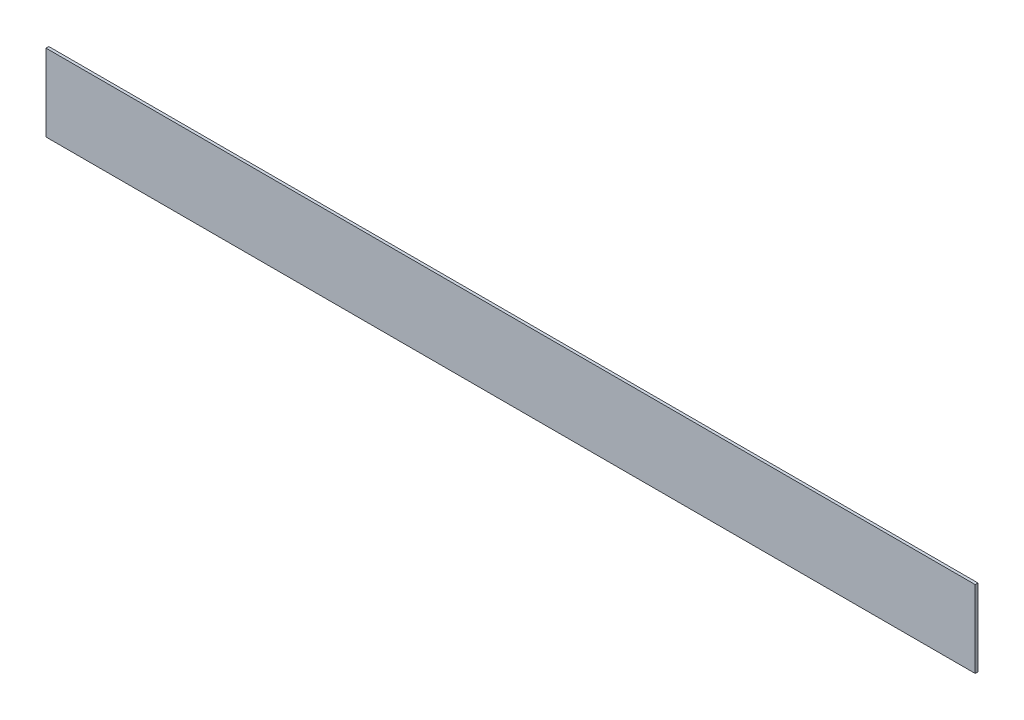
ISO-10303-21;
HEADER;
FILE_DESCRIPTION(('STEP AP214'),'2;1');
FILE_NAME('part.step','',(''),(''),'','','');
FILE_SCHEMA(('AUTOMOTIVE_DESIGN { 1 0 10303 214 1 1 1 1 }'));
ENDSEC;
DATA;
#1=APPLICATION_CONTEXT('core data for automotive mechanical design processes');
#2=APPLICATION_PROTOCOL_DEFINITION('international standard','automotive_design',2000,#1);
#3=PRODUCT_CONTEXT('',#1,'mechanical');
#4=PRODUCT('Part','Part','',(#3));
#5=PRODUCT_RELATED_PRODUCT_CATEGORY('part','',(#4));
#6=PRODUCT_DEFINITION_FORMATION('','',#4);
#7=PRODUCT_DEFINITION_CONTEXT('part definition',#1,'design');
#8=PRODUCT_DEFINITION('design','',#6,#7);
#9=PRODUCT_DEFINITION_SHAPE('','',#8);
#10=(LENGTH_UNIT() NAMED_UNIT(*) SI_UNIT(.MILLI.,.METRE.));
#11=(NAMED_UNIT(*) PLANE_ANGLE_UNIT() SI_UNIT($,.RADIAN.));
#12=(NAMED_UNIT(*) SI_UNIT($,.STERADIAN.) SOLID_ANGLE_UNIT());
#13=UNCERTAINTY_MEASURE_WITH_UNIT(LENGTH_MEASURE(1.E-05),#10,'distance_accuracy_value','');
#14=(GEOMETRIC_REPRESENTATION_CONTEXT(3) GLOBAL_UNCERTAINTY_ASSIGNED_CONTEXT((#13)) GLOBAL_UNIT_ASSIGNED_CONTEXT((#10,
#11,#12)) REPRESENTATION_CONTEXT('',''));
#15=CARTESIAN_POINT('',(0.,0.,0.));
#16=DIRECTION('',(0.,0.,1.));
#17=DIRECTION('',(1.,0.,0.));
#18=AXIS2_PLACEMENT_3D('',#15,#16,#17);
#19=CARTESIAN_POINT('',(5227.89312022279,0.,15.));
#20=DIRECTION('',(1.,0.,0.));
#21=DIRECTION('',(0.,0.,-1.));
#22=AXIS2_PLACEMENT_3D('',#19,#20,#21);
#23=PLANE('',#22);
#24=DIRECTION('',(0.,-1.,0.));
#25=VECTOR('',#24,1.);
#26=CARTESIAN_POINT('',(5227.89312022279,0.,0.));
#27=LINE('',#26,#25);
#28=CARTESIAN_POINT('',(5227.89312022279,-661.701885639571,0.));
#29=VERTEX_POINT('',#28);
#30=CARTESIAN_POINT('',(5227.89312022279,-1075.97188563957,0.));
#31=VERTEX_POINT('',#30);
#32=EDGE_CURVE('E98',#29,#31,#27,.T.);
#33=ORIENTED_EDGE('',*,*,#32,.F.);
#34=DIRECTION('',(0.,0.,-1.));
#35=VECTOR('',#34,1.);
#36=CARTESIAN_POINT('',(5227.89312022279,-661.701885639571,15.));
#37=LINE('',#36,#35);
#38=CARTESIAN_POINT('',(5227.89312022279,-661.701885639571,15.));
#39=VERTEX_POINT('',#38);
#40=EDGE_CURVE('E11',#39,#29,#37,.T.);
#41=ORIENTED_EDGE('',*,*,#40,.F.);
#42=DIRECTION('',(0.,-1.,0.));
#43=VECTOR('',#42,1.);
#44=CARTESIAN_POINT('',(5227.89312022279,0.,15.));
#45=LINE('',#44,#43);
#46=CARTESIAN_POINT('',(5227.89312022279,-1075.97188563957,15.));
#47=VERTEX_POINT('',#46);
#48=EDGE_CURVE('E91',#39,#47,#45,.T.);
#49=ORIENTED_EDGE('',*,*,#48,.T.);
#50=DIRECTION('',(0.,0.,-1.));
#51=VECTOR('',#50,1.);
#52=CARTESIAN_POINT('',(5227.89312022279,-1075.97188563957,15.));
#53=LINE('',#52,#51);
#54=EDGE_CURVE('E73',#47,#31,#53,.T.);
#55=ORIENTED_EDGE('',*,*,#54,.T.);
#56=EDGE_LOOP('',(#33,#41,#49,#55));
#57=FACE_BOUND('',#56,.T.);
#58=ADVANCED_FACE('F35',(#57),#23,.T.);
#59=CARTESIAN_POINT('',(0.,-661.701885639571,15.));
#60=DIRECTION('',(0.,1.,0.));
#61=DIRECTION('',(0.,0.,1.));
#62=AXIS2_PLACEMENT_3D('',#59,#60,#61);
#63=PLANE('',#62);
#64=DIRECTION('',(1.,0.,0.));
#65=VECTOR('',#64,1.);
#66=CARTESIAN_POINT('',(0.,-661.701885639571,0.));
#67=LINE('',#66,#65);
#68=CARTESIAN_POINT('',(227.893120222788,-661.701885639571,0.));
#69=VERTEX_POINT('',#68);
#70=EDGE_CURVE('E84',#69,#29,#67,.T.);
#71=ORIENTED_EDGE('',*,*,#70,.F.);
#72=DIRECTION('',(0.,0.,-1.));
#73=VECTOR('',#72,1.);
#74=CARTESIAN_POINT('',(227.893120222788,-661.701885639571,15.));
#75=LINE('',#74,#73);
#76=CARTESIAN_POINT('',(227.893120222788,-661.701885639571,15.));
#77=VERTEX_POINT('',#76);
#78=EDGE_CURVE('E43',#77,#69,#75,.T.);
#79=ORIENTED_EDGE('',*,*,#78,.F.);
#80=DIRECTION('',(1.,0.,0.));
#81=VECTOR('',#80,1.);
#82=CARTESIAN_POINT('',(0.,-661.701885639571,15.));
#83=LINE('',#82,#81);
#84=EDGE_CURVE('E82',#77,#39,#83,.T.);
#85=ORIENTED_EDGE('',*,*,#84,.T.);
#86=ORIENTED_EDGE('',*,*,#40,.T.);
#87=EDGE_LOOP('',(#71,#79,#85,#86));
#88=FACE_BOUND('',#87,.T.);
#89=ADVANCED_FACE('F81',(#88),#63,.T.);
#90=CARTESIAN_POINT('',(227.893120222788,0.,15.));
#91=DIRECTION('',(-1.,0.,0.));
#92=DIRECTION('',(0.,-1.,0.));
#93=AXIS2_PLACEMENT_3D('',#90,#91,#92);
#94=PLANE('',#93);
#95=DIRECTION('',(0.,1.,0.));
#96=VECTOR('',#95,1.);
#97=CARTESIAN_POINT('',(227.893120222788,0.,0.));
#98=LINE('',#97,#96);
#99=CARTESIAN_POINT('',(227.893120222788,-1075.97188563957,0.));
#100=VERTEX_POINT('',#99);
#101=EDGE_CURVE('E102',#100,#69,#98,.T.);
#102=ORIENTED_EDGE('',*,*,#101,.F.);
#103=DIRECTION('',(0.,0.,-1.));
#104=VECTOR('',#103,1.);
#105=CARTESIAN_POINT('',(227.893120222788,-1075.97188563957,15.));
#106=LINE('',#105,#104);
#107=CARTESIAN_POINT('',(227.893120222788,-1075.97188563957,15.));
#108=VERTEX_POINT('',#107);
#109=EDGE_CURVE('E66',#108,#100,#106,.T.);
#110=ORIENTED_EDGE('',*,*,#109,.F.);
#111=DIRECTION('',(0.,1.,0.));
#112=VECTOR('',#111,1.);
#113=CARTESIAN_POINT('',(227.893120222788,0.,15.));
#114=LINE('',#113,#112);
#115=EDGE_CURVE('E90',#108,#77,#114,.T.);
#116=ORIENTED_EDGE('',*,*,#115,.T.);
#117=ORIENTED_EDGE('',*,*,#78,.T.);
#118=EDGE_LOOP('',(#102,#110,#116,#117));
#119=FACE_BOUND('',#118,.T.);
#120=ADVANCED_FACE('F93',(#119),#94,.T.);
#121=CARTESIAN_POINT('',(0.,-1075.97188563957,15.));
#122=DIRECTION('',(0.,1.,0.));
#123=DIRECTION('',(0.,0.,1.));
#124=AXIS2_PLACEMENT_3D('',#121,#122,#123);
#125=PLANE('',#124);
#126=DIRECTION('',(1.,0.,0.));
#127=VECTOR('',#126,1.);
#128=CARTESIAN_POINT('',(0.,-1075.97188563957,0.));
#129=LINE('',#128,#127);
#130=EDGE_CURVE('E104',#100,#31,#129,.T.);
#131=ORIENTED_EDGE('',*,*,#130,.T.);
#132=ORIENTED_EDGE('',*,*,#54,.F.);
#133=DIRECTION('',(1.,0.,0.));
#134=VECTOR('',#133,1.);
#135=CARTESIAN_POINT('',(0.,-1075.97188563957,15.));
#136=LINE('',#135,#134);
#137=EDGE_CURVE('E51',#108,#47,#136,.T.);
#138=ORIENTED_EDGE('',*,*,#137,.F.);
#139=ORIENTED_EDGE('',*,*,#109,.T.);
#140=EDGE_LOOP('',(#131,#132,#138,#139));
#141=FACE_BOUND('',#140,.T.);
#142=ADVANCED_FACE('F114',(#141),#125,.F.);
#143=CARTESIAN_POINT('',(0.,0.,15.));
#144=DIRECTION('',(0.,0.,1.));
#145=DIRECTION('',(1.,0.,0.));
#146=AXIS2_PLACEMENT_3D('',#143,#144,#145);
#147=PLANE('',#146);
#148=ORIENTED_EDGE('',*,*,#48,.F.);
#149=ORIENTED_EDGE('',*,*,#84,.F.);
#150=ORIENTED_EDGE('',*,*,#115,.F.);
#151=ORIENTED_EDGE('',*,*,#137,.T.);
#152=EDGE_LOOP('',(#148,#149,#150,#151));
#153=FACE_BOUND('',#152,.T.);
#154=ADVANCED_FACE('F89',(#153),#147,.T.);
#155=CARTESIAN_POINT('',(0.,0.,0.));
#156=DIRECTION('',(0.,0.,1.));
#157=DIRECTION('',(1.,0.,0.));
#158=AXIS2_PLACEMENT_3D('',#155,#156,#157);
#159=PLANE('',#158);
#160=ORIENTED_EDGE('',*,*,#32,.T.);
#161=ORIENTED_EDGE('',*,*,#130,.F.);
#162=ORIENTED_EDGE('',*,*,#101,.T.);
#163=ORIENTED_EDGE('',*,*,#70,.T.);
#164=EDGE_LOOP('',(#160,#161,#162,#163));
#165=FACE_BOUND('',#164,.T.);
#166=ADVANCED_FACE('F119',(#165),#159,.F.);
#167=CLOSED_SHELL('',(#58,#89,#120,#142,#154,#166));
#168=MANIFOLD_SOLID_BREP('B2',#167);
#169=ADVANCED_BREP_SHAPE_REPRESENTATION('',(#18,#168),#14);
#170=SHAPE_DEFINITION_REPRESENTATION(#9,#169);
ENDSEC;
END-ISO-10303-21;
